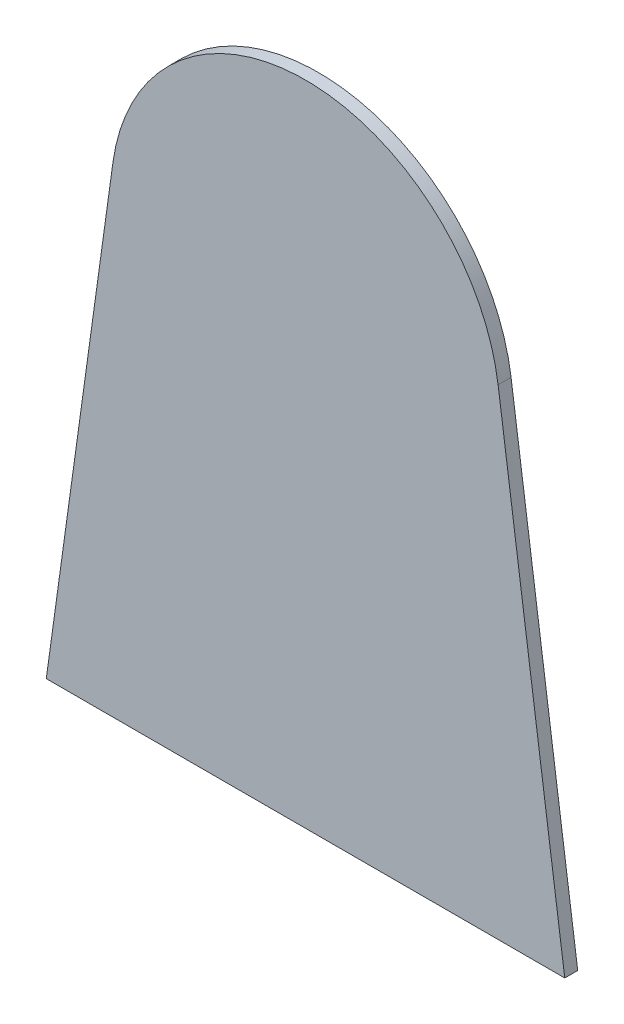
ISO-10303-21;
HEADER;
FILE_DESCRIPTION(('STEP AP214'),'2;1');
FILE_NAME('part.step','',(''),(''),'','','');
FILE_SCHEMA(('AUTOMOTIVE_DESIGN { 1 0 10303 214 1 1 1 1 }'));
ENDSEC;
DATA;
#1=APPLICATION_CONTEXT('core data for automotive mechanical design processes');
#2=APPLICATION_PROTOCOL_DEFINITION('international standard','automotive_design',2000,#1);
#3=PRODUCT_CONTEXT('',#1,'mechanical');
#4=PRODUCT('Part','Part','',(#3));
#5=PRODUCT_RELATED_PRODUCT_CATEGORY('part','',(#4));
#6=PRODUCT_DEFINITION_FORMATION('','',#4);
#7=PRODUCT_DEFINITION_CONTEXT('part definition',#1,'design');
#8=PRODUCT_DEFINITION('design','',#6,#7);
#9=PRODUCT_DEFINITION_SHAPE('','',#8);
#10=(LENGTH_UNIT() NAMED_UNIT(*) SI_UNIT(.MILLI.,.METRE.));
#11=(NAMED_UNIT(*) PLANE_ANGLE_UNIT() SI_UNIT($,.RADIAN.));
#12=(NAMED_UNIT(*) SI_UNIT($,.STERADIAN.) SOLID_ANGLE_UNIT());
#13=UNCERTAINTY_MEASURE_WITH_UNIT(LENGTH_MEASURE(1.E-05),#10,'distance_accuracy_value','');
#14=(GEOMETRIC_REPRESENTATION_CONTEXT(3) GLOBAL_UNCERTAINTY_ASSIGNED_CONTEXT((#13)) GLOBAL_UNIT_ASSIGNED_CONTEXT((#10,
#11,#12)) REPRESENTATION_CONTEXT('',''));
#15=CARTESIAN_POINT('',(0.,0.,0.));
#16=DIRECTION('',(0.,0.,1.));
#17=DIRECTION('',(1.,0.,0.));
#18=AXIS2_PLACEMENT_3D('',#15,#16,#17);
#19=CARTESIAN_POINT('',(0.,0.,10.));
#20=DIRECTION('',(0.,1.,0.));
#21=DIRECTION('',(0.,0.,1.));
#22=AXIS2_PLACEMENT_3D('',#19,#20,#21);
#23=PLANE('',#22);
#24=DIRECTION('',(1.,0.,0.));
#25=VECTOR('',#24,1.);
#26=CARTESIAN_POINT('',(0.,0.,0.));
#27=LINE('',#26,#25);
#28=CARTESIAN_POINT('',(-200.,0.,0.));
#29=VERTEX_POINT('',#28);
#30=CARTESIAN_POINT('',(200.,0.,0.));
#31=VERTEX_POINT('',#30);
#32=EDGE_CURVE('E72',#29,#31,#27,.T.);
#33=ORIENTED_EDGE('',*,*,#32,.T.);
#34=DIRECTION('',(0.,0.,-1.));
#35=VECTOR('',#34,1.);
#36=CARTESIAN_POINT('',(200.,0.,10.));
#37=LINE('',#36,#35);
#38=CARTESIAN_POINT('',(200.,0.,10.));
#39=VERTEX_POINT('',#38);
#40=EDGE_CURVE('E11',#39,#31,#37,.T.);
#41=ORIENTED_EDGE('',*,*,#40,.F.);
#42=DIRECTION('',(1.,0.,0.));
#43=VECTOR('',#42,1.);
#44=CARTESIAN_POINT('',(0.,0.,10.));
#45=LINE('',#44,#43);
#46=CARTESIAN_POINT('',(-200.,0.,10.));
#47=VERTEX_POINT('',#46);
#48=EDGE_CURVE('E77',#47,#39,#45,.T.);
#49=ORIENTED_EDGE('',*,*,#48,.F.);
#50=DIRECTION('',(0.,0.,-1.));
#51=VECTOR('',#50,1.);
#52=CARTESIAN_POINT('',(-200.,0.,10.));
#53=LINE('',#52,#51);
#54=EDGE_CURVE('E92',#47,#29,#53,.T.);
#55=ORIENTED_EDGE('',*,*,#54,.T.);
#56=EDGE_LOOP('',(#33,#41,#49,#55));
#57=FACE_BOUND('',#56,.T.);
#58=ADVANCED_FACE('F32',(#57),#23,.F.);
#59=CARTESIAN_POINT('',(200.,0.,10.));
#60=DIRECTION('',(-0.990510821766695,-0.137434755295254,0.));
#61=DIRECTION('',(0.137434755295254,-0.990510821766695,0.));
#62=AXIS2_PLACEMENT_3D('',#59,#60,#61);
#63=PLANE('',#62);
#64=DIRECTION('',(-0.137434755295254,0.990510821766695,0.));
#65=VECTOR('',#64,1.);
#66=CARTESIAN_POINT('',(200.,0.,0.));
#67=LINE('',#66,#65);
#68=CARTESIAN_POINT('',(148.576623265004,370.615213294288,0.));
#69=VERTEX_POINT('',#68);
#70=EDGE_CURVE('E88',#31,#69,#67,.T.);
#71=ORIENTED_EDGE('',*,*,#70,.T.);
#72=DIRECTION('',(0.,0.,-1.));
#73=VECTOR('',#72,1.);
#74=CARTESIAN_POINT('',(148.576623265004,370.615213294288,10.));
#75=LINE('',#74,#73);
#76=CARTESIAN_POINT('',(148.576623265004,370.615213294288,10.));
#77=VERTEX_POINT('',#76);
#78=EDGE_CURVE('E40',#77,#69,#75,.T.);
#79=ORIENTED_EDGE('',*,*,#78,.F.);
#80=DIRECTION('',(-0.137434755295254,0.990510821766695,0.));
#81=VECTOR('',#80,1.);
#82=CARTESIAN_POINT('',(200.,0.,10.));
#83=LINE('',#82,#81);
#84=EDGE_CURVE('E80',#39,#77,#83,.T.);
#85=ORIENTED_EDGE('',*,*,#84,.F.);
#86=ORIENTED_EDGE('',*,*,#40,.T.);
#87=EDGE_LOOP('',(#71,#79,#85,#86));
#88=FACE_BOUND('',#87,.T.);
#89=ADVANCED_FACE('F87',(#88),#63,.F.);
#90=CARTESIAN_POINT('',(0.,350.,10.));
#91=DIRECTION('',(0.,0.,-1.));
#92=DIRECTION('',(-1.,0.,0.));
#93=AXIS2_PLACEMENT_3D('',#90,#91,#92);
#94=CYLINDRICAL_SURFACE('',#93,150.);
#95=CARTESIAN_POINT('',(0.,350.,0.));
#96=DIRECTION('',(0.,0.,1.));
#97=DIRECTION('',(1.,0.,0.));
#98=AXIS2_PLACEMENT_3D('',#95,#96,#97);
#99=CIRCLE('',#98,150.);
#100=CARTESIAN_POINT('',(-148.576623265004,370.615213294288,0.));
#101=VERTEX_POINT('',#100);
#102=EDGE_CURVE('E65',#69,#101,#99,.T.);
#103=ORIENTED_EDGE('',*,*,#102,.T.);
#104=DIRECTION('',(0.,0.,-1.));
#105=VECTOR('',#104,1.);
#106=CARTESIAN_POINT('',(-148.576623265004,370.615213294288,10.));
#107=LINE('',#106,#105);
#108=CARTESIAN_POINT('',(-148.576623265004,370.615213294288,10.));
#109=VERTEX_POINT('',#108);
#110=EDGE_CURVE('E89',#109,#101,#107,.T.);
#111=ORIENTED_EDGE('',*,*,#110,.F.);
#112=CARTESIAN_POINT('',(0.,350.,10.));
#113=DIRECTION('',(0.,0.,1.));
#114=DIRECTION('',(1.,0.,0.));
#115=AXIS2_PLACEMENT_3D('',#112,#113,#114);
#116=CIRCLE('',#115,150.);
#117=EDGE_CURVE('E84',#77,#109,#116,.T.);
#118=ORIENTED_EDGE('',*,*,#117,.F.);
#119=ORIENTED_EDGE('',*,*,#78,.T.);
#120=EDGE_LOOP('',(#103,#111,#118,#119));
#121=FACE_BOUND('',#120,.T.);
#122=ADVANCED_FACE('F90',(#121),#94,.T.);
#123=CARTESIAN_POINT('',(-200.,0.,10.));
#124=DIRECTION('',(0.990510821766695,-0.137434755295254,0.));
#125=DIRECTION('',(0.137434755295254,0.990510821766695,0.));
#126=AXIS2_PLACEMENT_3D('',#123,#124,#125);
#127=PLANE('',#126);
#128=DIRECTION('',(-0.137434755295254,-0.990510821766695,0.));
#129=VECTOR('',#128,1.);
#130=CARTESIAN_POINT('',(-200.,0.,0.));
#131=LINE('',#130,#129);
#132=EDGE_CURVE('E99',#101,#29,#131,.T.);
#133=ORIENTED_EDGE('',*,*,#132,.T.);
#134=ORIENTED_EDGE('',*,*,#54,.F.);
#135=DIRECTION('',(-0.137434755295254,-0.990510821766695,0.));
#136=VECTOR('',#135,1.);
#137=CARTESIAN_POINT('',(-200.,0.,10.));
#138=LINE('',#137,#136);
#139=EDGE_CURVE('E48',#109,#47,#138,.T.);
#140=ORIENTED_EDGE('',*,*,#139,.F.);
#141=ORIENTED_EDGE('',*,*,#110,.T.);
#142=EDGE_LOOP('',(#133,#134,#140,#141));
#143=FACE_BOUND('',#142,.T.);
#144=ADVANCED_FACE('F104',(#143),#127,.F.);
#145=CARTESIAN_POINT('',(0.,350.,10.));
#146=DIRECTION('',(0.,0.,1.));
#147=DIRECTION('',(1.,0.,0.));
#148=AXIS2_PLACEMENT_3D('',#145,#146,#147);
#149=PLANE('',#148);
#150=ORIENTED_EDGE('',*,*,#48,.T.);
#151=ORIENTED_EDGE('',*,*,#84,.T.);
#152=ORIENTED_EDGE('',*,*,#117,.T.);
#153=ORIENTED_EDGE('',*,*,#139,.T.);
#154=EDGE_LOOP('',(#150,#151,#152,#153));
#155=FACE_BOUND('',#154,.T.);
#156=ADVANCED_FACE('F82',(#155),#149,.T.);
#157=CARTESIAN_POINT('',(0.,350.,0.));
#158=DIRECTION('',(0.,0.,1.));
#159=DIRECTION('',(1.,0.,0.));
#160=AXIS2_PLACEMENT_3D('',#157,#158,#159);
#161=PLANE('',#160);
#162=ORIENTED_EDGE('',*,*,#32,.F.);
#163=ORIENTED_EDGE('',*,*,#132,.F.);
#164=ORIENTED_EDGE('',*,*,#102,.F.);
#165=ORIENTED_EDGE('',*,*,#70,.F.);
#166=EDGE_LOOP('',(#162,#163,#164,#165));
#167=FACE_BOUND('',#166,.T.);
#168=ADVANCED_FACE('F105',(#167),#161,.F.);
#169=CLOSED_SHELL('',(#58,#89,#122,#144,#156,#168));
#170=MANIFOLD_SOLID_BREP('B2',#169);
#171=ADVANCED_BREP_SHAPE_REPRESENTATION('',(#18,#170),#14);
#172=SHAPE_DEFINITION_REPRESENTATION(#9,#171);
ENDSEC;
END-ISO-10303-21;
